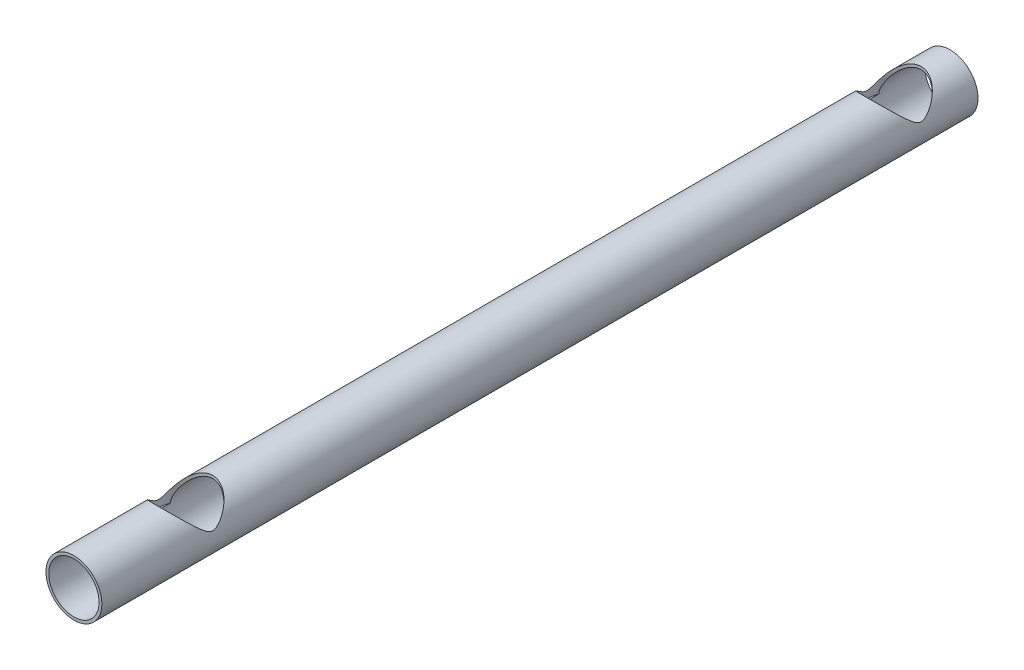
from build123d import *

# Parameters (mm, degrees)
ESQUISSE2_R      = 15
ESQUISSE2_R_2    = 13.5
EXTRUSION1_DEPTH = 470
ESQUISSE3_R      = 14.5
EXTRUSION4_DEPTH = 15


with BuildPart() as part:
    # Esquisse2 → Extrusion1 (new body)
    with BuildSketch(Plane.XY):
        with Locations(Location((0, 0, 0), (0, 0, 180))):
            Circle(ESQUISSE2_R)
        with Locations(Location((0, 0, 0), (0, 0, 180))):
            Circle(ESQUISSE2_R_2, mode=Mode.SUBTRACT)
    extrude(amount=EXTRUSION1_DEPTH)

    # Esquisse3 → Extrusion4 (cut)
    with BuildSketch(Plane(origin=(0, 15, 0), x_dir=(-1, 0, 0), z_dir=(0, 1, 0))):
        with Locations(Location((0, 30, 0), (0, 0, 90))):
            Circle(ESQUISSE3_R)
        with Locations(Location((0, 410, 0), (0, 0, 90))):
            Circle(ESQUISSE3_R)
    extrude(amount=-EXTRUSION4_DEPTH, mode=Mode.SUBTRACT)


solid = part.part
